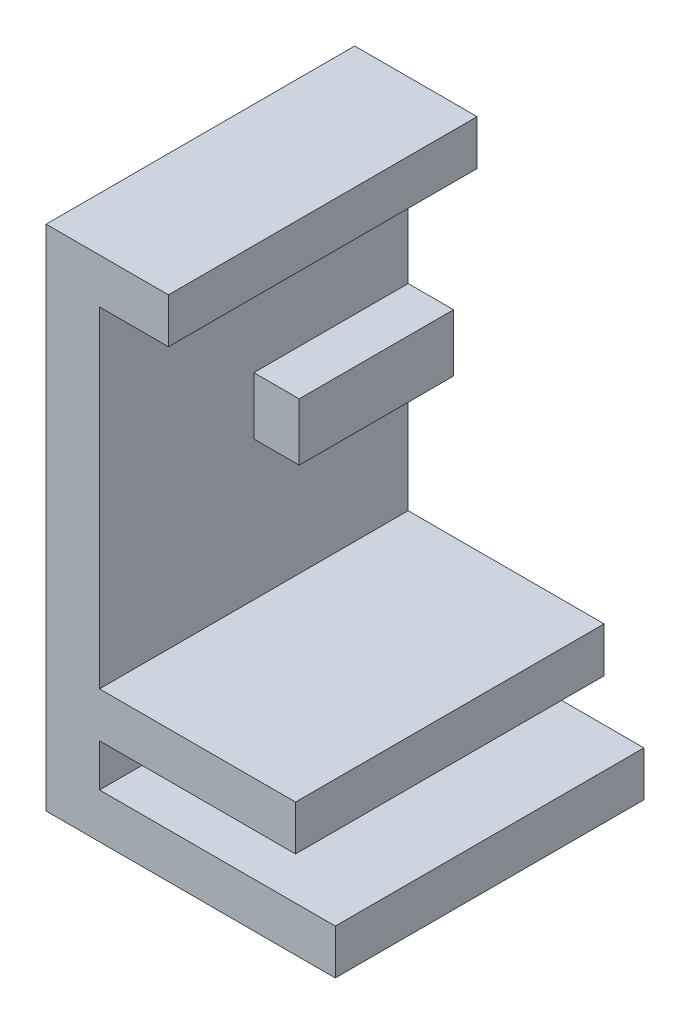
from build123d import *

# Parameters (mm, degrees)
EXTRUDE1_DEPTH     = 47.5
CUT_EXTRUDE1_REACH = 190.764
SKETCH3_W          = 13.972525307
SKETCH3_H          = 47.5


with BuildPart() as part:
    # Sketch1 → Extrude1 (new, symmetric)
    with BuildSketch(Plane(origin=(8.56426308, -28.387824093, 0), x_dir=(0, 1, 0), z_dir=(0, 0, 1))):
        Polygon((-58.163386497, -54.421285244), (98.277260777, -54.421285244), (98.277260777, -92.090296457), (84.43636424, -92.090296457), (84.43636424, -70.863158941), (43.179274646, -70.863158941), (43.179274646, -84.835684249), (25.496253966, -84.835684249), (25.496253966, -70.863158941), (-17.378927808, -70.863158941), (-17.378927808, -131.201948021), (-31.219824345, -131.201948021), (-31.219824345, -70.863158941), (-44.32248996, -70.863158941), (-44.32248996, -143.440294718), (-58.163386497, -143.440294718), align=None)
    extrude(amount=EXTRUDE1_DEPTH, both=True)

    # Sketch3 → Cut-Extrude1 (cut, up to next)
    with BuildSketch(Plane(origin=(0, 14.791450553, 0), x_dir=(-1, 0, 0), z_dir=(0, 1, 0)), mode=Mode.PRIVATE) as cut_extrude1_sk1:
        with Locations((-86.413684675, 23.75)):
            Rectangle(SKETCH3_W, SKETCH3_H)
    cut_extrude1_tool1 = extrude(cut_extrude1_sk1.sketch, amount=-CUT_EXTRUDE1_REACH, mode=Mode.PRIVATE) & part.part
    add(cut_extrude1_tool1.solids().sort_by_distance((86.413685, 14.791451, 23.75))[0], mode=Mode.SUBTRACT)


solid = part.part
